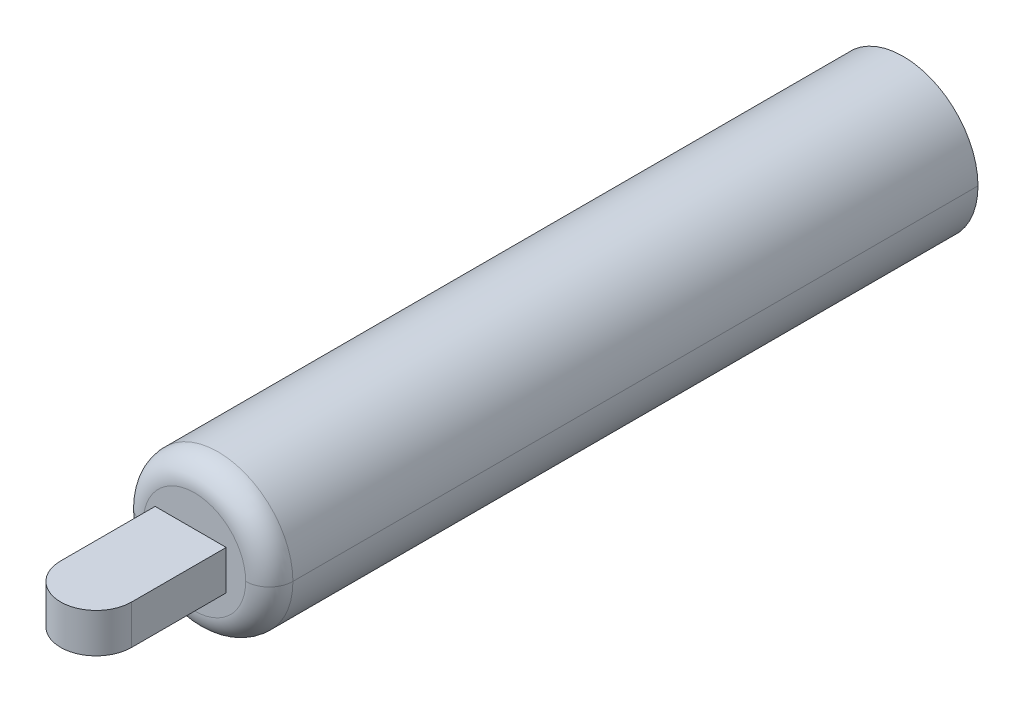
ISO-10303-21;
HEADER;
FILE_DESCRIPTION(('STEP AP214'),'2;1');
FILE_NAME('part.step','',(''),(''),'','','');
FILE_SCHEMA(('AUTOMOTIVE_DESIGN { 1 0 10303 214 1 1 1 1 }'));
ENDSEC;
DATA;
#1=APPLICATION_CONTEXT('core data for automotive mechanical design processes');
#2=APPLICATION_PROTOCOL_DEFINITION('international standard','automotive_design',2000,#1);
#3=PRODUCT_CONTEXT('',#1,'mechanical');
#4=PRODUCT('Part','Part','',(#3));
#5=PRODUCT_RELATED_PRODUCT_CATEGORY('part','',(#4));
#6=PRODUCT_DEFINITION_FORMATION('','',#4);
#7=PRODUCT_DEFINITION_CONTEXT('part definition',#1,'design');
#8=PRODUCT_DEFINITION('design','',#6,#7);
#9=PRODUCT_DEFINITION_SHAPE('','',#8);
#10=(LENGTH_UNIT() NAMED_UNIT(*) SI_UNIT(.MILLI.,.METRE.));
#11=(NAMED_UNIT(*) PLANE_ANGLE_UNIT() SI_UNIT($,.RADIAN.));
#12=(NAMED_UNIT(*) SI_UNIT($,.STERADIAN.) SOLID_ANGLE_UNIT());
#13=UNCERTAINTY_MEASURE_WITH_UNIT(LENGTH_MEASURE(1.E-05),#10,'distance_accuracy_value','');
#14=(GEOMETRIC_REPRESENTATION_CONTEXT(3) GLOBAL_UNCERTAINTY_ASSIGNED_CONTEXT((#13)) GLOBAL_UNIT_ASSIGNED_CONTEXT((#10,
#11,#12)) REPRESENTATION_CONTEXT('',''));
#15=CARTESIAN_POINT('',(0.,0.,0.));
#16=DIRECTION('',(0.,0.,1.));
#17=DIRECTION('',(1.,0.,0.));
#18=AXIS2_PLACEMENT_3D('',#15,#16,#17);
#19=CARTESIAN_POINT('',(0.,0.,220.));
#20=DIRECTION('',(0.,0.,-1.));
#21=DIRECTION('',(1.,0.,0.));
#22=AXIS2_PLACEMENT_3D('',#19,#20,#21);
#23=PLANE('',#22);
#24=CARTESIAN_POINT('',(0.,0.,220.));
#25=DIRECTION('',(0.,0.,-1.));
#26=DIRECTION('',(1.,0.,0.));
#27=AXIS2_PLACEMENT_3D('',#24,#25,#26);
#28=CIRCLE('',#27,19.);
#29=CARTESIAN_POINT('',(-19.,0.,220.));
#30=VERTEX_POINT('',#29);
#31=CARTESIAN_POINT('',(19.,0.,220.));
#32=VERTEX_POINT('',#31);
#33=EDGE_CURVE('E36',#30,#32,#28,.T.);
#34=ORIENTED_EDGE('',*,*,#33,.T.);
#35=CARTESIAN_POINT('',(0.,0.,220.));
#36=DIRECTION('',(0.,0.,-1.));
#37=DIRECTION('',(1.,0.,0.));
#38=AXIS2_PLACEMENT_3D('',#35,#36,#37);
#39=CIRCLE('',#38,19.);
#40=EDGE_CURVE('E13',#32,#30,#39,.T.);
#41=ORIENTED_EDGE('',*,*,#40,.T.);
#42=EDGE_LOOP('',(#34,#41));
#43=FACE_BOUND('',#42,.T.);
#44=ADVANCED_FACE('F25',(#43),#23,.T.);
#45=CARTESIAN_POINT('',(0.,0.,260.));
#46=DIRECTION('',(0.,0.,-1.));
#47=DIRECTION('',(1.,0.,0.));
#48=AXIS2_PLACEMENT_3D('',#45,#46,#47);
#49=CYLINDRICAL_SURFACE('',#48,19.);
#50=DIRECTION('',(0.,0.,1.));
#51=VECTOR('',#50,1.);
#52=CARTESIAN_POINT('',(19.,0.,260.));
#53=LINE('',#52,#51);
#54=CARTESIAN_POINT('',(19.,0.,394.));
#55=VERTEX_POINT('',#54);
#56=EDGE_CURVE('E29',#32,#55,#53,.T.);
#57=ORIENTED_EDGE('',*,*,#56,.T.);
#58=CARTESIAN_POINT('',(0.,0.,394.));
#59=DIRECTION('',(0.,0.,1.));
#60=DIRECTION('',(1.,0.,0.));
#61=AXIS2_PLACEMENT_3D('',#58,#59,#60);
#62=CIRCLE('',#61,19.);
#63=CARTESIAN_POINT('',(-19.,0.,394.));
#64=VERTEX_POINT('',#63);
#65=EDGE_CURVE('E169',#64,#55,#62,.T.);
#66=ORIENTED_EDGE('',*,*,#65,.F.);
#67=DIRECTION('',(0.,0.,1.));
#68=VECTOR('',#67,1.);
#69=CARTESIAN_POINT('',(-19.,0.,260.));
#70=LINE('',#69,#68);
#71=EDGE_CURVE('E189',#30,#64,#70,.T.);
#72=ORIENTED_EDGE('',*,*,#71,.F.);
#73=ORIENTED_EDGE('',*,*,#40,.F.);
#74=EDGE_LOOP('',(#57,#66,#72,#73));
#75=FACE_BOUND('',#74,.T.);
#76=ADVANCED_FACE('F270',(#75),#49,.T.);
#77=CARTESIAN_POINT('',(0.,0.,260.));
#78=DIRECTION('',(0.,0.,-1.));
#79=DIRECTION('',(1.,0.,0.));
#80=AXIS2_PLACEMENT_3D('',#77,#78,#79);
#81=CYLINDRICAL_SURFACE('',#80,19.);
#82=ORIENTED_EDGE('',*,*,#71,.T.);
#83=CARTESIAN_POINT('',(0.,0.,394.));
#84=DIRECTION('',(0.,0.,1.));
#85=DIRECTION('',(1.,0.,0.));
#86=AXIS2_PLACEMENT_3D('',#83,#84,#85);
#87=CIRCLE('',#86,19.);
#88=EDGE_CURVE('E164',#55,#64,#87,.T.);
#89=ORIENTED_EDGE('',*,*,#88,.F.);
#90=ORIENTED_EDGE('',*,*,#56,.F.);
#91=ORIENTED_EDGE('',*,*,#33,.F.);
#92=EDGE_LOOP('',(#82,#89,#90,#91));
#93=FACE_BOUND('',#92,.T.);
#94=ADVANCED_FACE('F275',(#93),#81,.T.);
#95=CARTESIAN_POINT('',(-0.974897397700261,-2.80209038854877,423.999785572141));
#96=DIRECTION('',(-0.392752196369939,-7.47806600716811E-07,-0.919644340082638));
#97=DIRECTION('',(0.919340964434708,-0.0256841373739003,-0.392622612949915));
#98=AXIS2_PLACEMENT_3D('',#95,#96,#97);
#99=SPHERICAL_SURFACE('',#98,6.);
#100=CARTESIAN_POINT('',(1.20483022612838,-5.,418.859943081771));
#101=CARTESIAN_POINT('',(1.56529956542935,-5.,419.012812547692));
#102=CARTESIAN_POINT('',(1.91663037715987,-5.,419.199090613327));
#103=CARTESIAN_POINT('',(2.25187179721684,-5.,419.417606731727));
#104=CARTESIAN_POINT('',(2.91258805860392,-5.,419.937987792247));
#105=CARTESIAN_POINT('',(3.46649602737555,-5.,420.574014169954));
#106=CARTESIAN_POINT('',(3.72304659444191,-5.,420.935313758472));
#107=CARTESIAN_POINT('',(4.16647281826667,-5.,421.71224264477));
#108=CARTESIAN_POINT('',(4.44790115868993,-5.,422.561591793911));
#109=CARTESIAN_POINT('',(4.54632647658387,-5.,423.00406483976));
#110=CARTESIAN_POINT('',(4.63400133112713,-5.,423.746141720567));
#111=CARTESIAN_POINT('',(4.59812564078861,-5.,424.489306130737));
#112=CARTESIAN_POINT('',(4.56475118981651,-5.,424.780923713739));
#113=CARTESIAN_POINT('',(4.4886253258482,-5.,425.199961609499));
#114=CARTESIAN_POINT('',(4.37418506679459,-5.,425.606855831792));
#115=CARTESIAN_POINT('',(4.3347329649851,-5.,425.732703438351));
#116=CARTESIAN_POINT('',(4.2917253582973,-5.,425.856936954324));
#117=CARTESIAN_POINT('',(4.24531439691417,-5.,425.979326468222));
#118=(BOUNDED_CURVE() B_SPLINE_CURVE(5,(#100,#101,#102,#103,#104,#105,#106,#107,#108,#109,#110,
#111,#112,#113,#114,#115,#116,#117),.UNSPECIFIED.,.F.,.F.) B_SPLINE_CURVE_WITH_KNOTS((6,3,3,3,3,
6),(0.,2.82262714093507,5.93491516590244,9.11765543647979,11.1916300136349,12.1352366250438),
.UNSPECIFIED.) CURVE() GEOMETRIC_REPRESENTATION_ITEM() RATIONAL_B_SPLINE_CURVE((1.,1.,1.,1.,1.,
1.,1.,1.,1.,1.,1.,1.,1.,1.,1.,1.,1.,1.)) REPRESENTATION_ITEM(''));
#119=CARTESIAN_POINT('',(1.20483022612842,-5.,418.859943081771));
#120=VERTEX_POINT('',#119);
#121=CARTESIAN_POINT('',(4.24531439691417,-5.,425.979326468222));
#122=VERTEX_POINT('',#121);
#123=EDGE_CURVE('E176',#120,#122,#118,.T.);
#124=ORIENTED_EDGE('',*,*,#123,.T.);
#125=CARTESIAN_POINT('',(-0.974897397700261,-2.80209038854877,423.999785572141));
#126=DIRECTION('',(0.440899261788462,0.877583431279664,-0.188295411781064));
#127=DIRECTION('',(0.807064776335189,-0.479423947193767,-0.344672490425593));
#128=AXIS2_PLACEMENT_3D('',#125,#126,#127);
#129=CIRCLE('',#128,6.);
#130=CARTESIAN_POINT('',(1.38161578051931,-2.80208590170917,429.517651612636));
#131=VERTEX_POINT('',#130);
#132=EDGE_CURVE('E195',#131,#122,#129,.T.);
#133=ORIENTED_EDGE('',*,*,#132,.F.);
#134=CARTESIAN_POINT('',(-0.974897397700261,-2.80209038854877,423.999785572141));
#135=DIRECTION('',(-0.440899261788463,-0.877583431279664,0.188295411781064));
#136=DIRECTION('',(-0.807064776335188,0.479423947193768,0.344672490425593));
#137=AXIS2_PLACEMENT_3D('',#134,#135,#136);
#138=CIRCLE('',#137,6.);
#139=CARTESIAN_POINT('',(-3.33141057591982,-2.80209487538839,418.481919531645));
#140=VERTEX_POINT('',#139);
#141=EDGE_CURVE('E217',#131,#140,#138,.T.);
#142=ORIENTED_EDGE('',*,*,#141,.T.);
#143=CARTESIAN_POINT('',(-0.974897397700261,-2.80209038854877,423.999785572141));
#144=DIRECTION('',(0.440899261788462,0.877583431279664,-0.188295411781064));
#145=DIRECTION('',(0.807064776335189,-0.479423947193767,-0.344672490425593));
#146=AXIS2_PLACEMENT_3D('',#143,#144,#145);
#147=CIRCLE('',#146,6.);
#148=EDGE_CURVE('E188',#120,#140,#147,.T.);
#149=ORIENTED_EDGE('',*,*,#148,.F.);
#150=EDGE_LOOP('',(#124,#133,#142,#149));
#151=FACE_BOUND('',#150,.T.);
#152=ADVANCED_FACE('F265',(#151),#99,.F.);
#153=CARTESIAN_POINT('',(-0.974897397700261,-2.80209038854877,423.999785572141));
#154=DIRECTION('',(-0.392752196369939,-7.47806600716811E-07,-0.919644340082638));
#155=DIRECTION('',(0.919340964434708,-0.0256841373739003,-0.392622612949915));
#156=AXIS2_PLACEMENT_3D('',#153,#154,#155);
#157=SPHERICAL_SURFACE('',#156,6.);
#158=CARTESIAN_POINT('',(1.20483022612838,-5.,418.859943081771));
#159=CARTESIAN_POINT('',(0.974144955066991,-5.,418.762113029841));
#160=CARTESIAN_POINT('',(0.739717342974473,-5.,418.677965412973));
#161=CARTESIAN_POINT('',(0.503302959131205,-5.,418.607812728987));
#162=CARTESIAN_POINT('',(0.0558490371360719,-5.,418.50141763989));
#163=CARTESIAN_POINT('',(-0.377747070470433,-5.,418.44317686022));
#164=CARTESIAN_POINT('',(-0.57761291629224,-5.,418.425868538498));
#165=CARTESIAN_POINT('',(-0.909399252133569,-5.,418.411582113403));
#166=CARTESIAN_POINT('',(-1.2153268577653,-5.,418.419862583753));
#167=CARTESIAN_POINT('',(-1.33882200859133,-5.,418.426773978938));
#168=CARTESIAN_POINT('',(-1.58124733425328,-5.,418.446785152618));
#169=CARTESIAN_POINT('',(-1.80346256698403,-5.,418.476943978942));
#170=CARTESIAN_POINT('',(-1.91204442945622,-5.,418.494507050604));
#171=CARTESIAN_POINT('',(-2.1330949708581,-5.,418.535593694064));
#172=CARTESIAN_POINT('',(-2.33579041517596,-5.,418.583617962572));
#173=CARTESIAN_POINT('',(-2.4387550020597,-5.,418.610670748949));
#174=CARTESIAN_POINT('',(-2.74720218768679,-5.,418.699279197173));
#175=CARTESIAN_POINT('',(-3.02707013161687,-5.,418.802024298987));
#176=CARTESIAN_POINT('',(-3.21013373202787,-5.,418.878148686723));
#177=CARTESIAN_POINT('',(-3.47179212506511,-5.,419.000076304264));
#178=CARTESIAN_POINT('',(-3.73951622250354,-5.,419.148041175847));
#179=CARTESIAN_POINT('',(-3.82258921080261,-5.,419.196230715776));
#180=CARTESIAN_POINT('',(-4.04575330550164,-5.,419.332274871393));
#181=CARTESIAN_POINT('',(-4.28027752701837,-5.,419.495074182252));
#182=CARTESIAN_POINT('',(-4.43210247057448,-5.,419.609317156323));
#183=CARTESIAN_POINT('',(-4.7132328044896,-5.,419.841410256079));
#184=CARTESIAN_POINT('',(-5.00715397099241,-5.,420.131854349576));
#185=CARTESIAN_POINT('',(-5.13725763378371,-5.,420.271228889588));
#186=CARTESIAN_POINT('',(-5.35847636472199,-5.,420.530887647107));
#187=CARTESIAN_POINT('',(-5.57028554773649,-5.,420.823955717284));
#188=CARTESIAN_POINT('',(-5.65574871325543,-5.,420.95104776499));
#189=CARTESIAN_POINT('',(-5.82318884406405,-5.,421.219944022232));
#190=CARTESIAN_POINT('',(-5.97473820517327,-5.,421.507373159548));
#191=CARTESIAN_POINT('',(-6.04707710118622,-5.,421.65790207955));
#192=CARTESIAN_POINT('',(-6.26564611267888,-5.,422.160494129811));
#193=CARTESIAN_POINT('',(-6.42451566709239,-5.,422.696848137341));
#194=CARTESIAN_POINT('',(-6.50208590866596,-5.,423.079397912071));
#195=CARTESIAN_POINT('',(-6.59541301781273,-5.,423.903810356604));
#196=CARTESIAN_POINT('',(-6.53555057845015,-5.,424.734058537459));
#197=CARTESIAN_POINT('',(-6.46051109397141,-5.,425.169330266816));
#198=CARTESIAN_POINT('',(-6.22293074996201,-5.,426.030353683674));
#199=CARTESIAN_POINT('',(-5.82022250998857,-5.,426.827871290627));
#200=CARTESIAN_POINT('',(-5.57607349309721,-5.,427.209868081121));
#201=CARTESIAN_POINT('',(-5.11150469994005,-5.,427.796286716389));
#202=CARTESIAN_POINT('',(-4.55863902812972,-5.,428.295807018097));
#203=CARTESIAN_POINT('',(-4.32763327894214,-5.,428.478388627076));
#204=CARTESIAN_POINT('',(-3.85847345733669,-5.,428.801352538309));
#205=CARTESIAN_POINT('',(-3.35592294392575,-5.,429.060618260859));
#206=CARTESIAN_POINT('',(-3.10627263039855,-5.,429.170549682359));
#207=CARTESIAN_POINT('',(-2.62837090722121,-5.,429.346963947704));
#208=CARTESIAN_POINT('',(-2.14807709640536,-5.,429.465408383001));
#209=CARTESIAN_POINT('',(-1.92408252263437,-5.,429.508278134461));
#210=CARTESIAN_POINT('',(-1.60401553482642,-5.,429.552989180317));
#211=CARTESIAN_POINT('',(-1.29898683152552,-5.,429.57453791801));
#212=CARTESIAN_POINT('',(-1.20478326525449,-5.,429.579150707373));
#213=CARTESIAN_POINT('',(-0.9757190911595,-5.,429.585619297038));
#214=CARTESIAN_POINT('',(-0.759303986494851,-5.,429.580748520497));
#215=CARTESIAN_POINT('',(-0.635046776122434,-5.,429.574340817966));
#216=CARTESIAN_POINT('',(-0.391424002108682,-5.,429.55526436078));
#217=CARTESIAN_POINT('',(-0.168034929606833,-5.,429.525851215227));
#218=CARTESIAN_POINT('',(-0.0590306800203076,-5.,429.508654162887));
#219=CARTESIAN_POINT('',(0.162536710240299,-5.,429.468344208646));
#220=CARTESIAN_POINT('',(0.365635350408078,-5.,429.421027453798));
#221=CARTESIAN_POINT('',(0.46863957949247,-5.,429.394376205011));
#222=CARTESIAN_POINT('',(0.777074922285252,-5.,429.307027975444));
#223=CARTESIAN_POINT('',(1.05642928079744,-5.,429.20568559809));
#224=CARTESIAN_POINT('',(1.23886330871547,-5.,429.13067102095));
#225=CARTESIAN_POINT('',(1.49989254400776,-5.,429.010371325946));
#226=CARTESIAN_POINT('',(1.7662218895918,-5.,428.864841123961));
#227=CARTESIAN_POINT('',(1.84935187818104,-5.,428.81715305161));
#228=CARTESIAN_POINT('',(2.07322455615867,-5.,428.682173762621));
#229=CARTESIAN_POINT('',(2.30827205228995,-5.,428.520715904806));
#230=CARTESIAN_POINT('',(2.46073460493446,-5.,428.407160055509));
#231=CARTESIAN_POINT('',(2.74270900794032,-5.,428.176709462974));
#232=CARTESIAN_POINT('',(3.03817458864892,-5.,427.887593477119));
#233=CARTESIAN_POINT('',(3.16882109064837,-5.,427.749040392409));
#234=CARTESIAN_POINT('',(3.39090077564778,-5.,427.49101783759));
#235=CARTESIAN_POINT('',(3.60406895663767,-5.,427.199214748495));
#236=CARTESIAN_POINT('',(3.68996090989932,-5.,427.072910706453));
#237=CARTESIAN_POINT('',(3.8670874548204,-5.,426.791779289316));
#238=CARTESIAN_POINT('',(4.02696656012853,-5.,426.48990358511));
#239=CARTESIAN_POINT('',(4.10635640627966,-5.,426.323868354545));
#240=CARTESIAN_POINT('',(4.17928023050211,-5.,426.153463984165));
#241=CARTESIAN_POINT('',(4.24531439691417,-5.,425.979326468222));
#242=(BOUNDED_CURVE() B_SPLINE_CURVE(5,(#158,#159,#160,#161,#162,#163,#164,#165,#166,#167,#168,
#169,#170,#171,#172,#173,#174,#175,#176,#177,#178,#179,#180,#181,#182,#183,#184,#185,#186,#187,
#188,#189,#190,#191,#192,#193,#194,#195,#196,#197,#198,#199,#200,#201,#202,#203,#204,#205,#206,
#207,#208,#209,#210,#211,#212,#213,#214,#215,#216,#217,#218,#219,#220,#221,#222,#223,#224,#225,
#226,#227,#228,#229,#230,#231,#232,#233,#234,#235,#236,#237,#238,#239,#240,#241),.UNSPECIFIED.,
.F.,.F.) B_SPLINE_CURVE_WITH_KNOTS((6,3,3,3,3,3,3,3,3,3,3,3,3,3,3,3,3,3,3,3,3,3,3,3,3,3,3,6),
(0.,1.80636308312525,3.43217170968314,4.60938116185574,5.84082462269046,7.22729750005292,
10.1479292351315,11.4397263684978,13.5637272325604,15.2223743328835,16.3993946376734,
17.6189101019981,20.3744150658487,23.476788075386,26.6600365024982,28.7397489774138,
30.6929987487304,32.4239847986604,33.2181559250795,34.3951243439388,35.6227300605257,
37.0011054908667,39.9047750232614,41.2014228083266,43.3439529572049,45.0099721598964,
46.1870602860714,47.5296369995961),
.UNSPECIFIED.) CURVE() GEOMETRIC_REPRESENTATION_ITEM() RATIONAL_B_SPLINE_CURVE((1.,1.,1.,1.,1.,
1.,1.,1.,1.,1.,1.,1.,1.,1.,1.,1.,1.,1.,1.,1.,1.,1.,1.,1.,1.,1.,1.,1.,1.,1.,1.,1.,1.,1.,1.,1.,1.,
1.,1.,1.,1.,1.,1.,1.,1.,1.,1.,1.,1.,1.,1.,1.,1.,1.,1.,1.,1.,1.,1.,1.,1.,1.,1.,1.,1.,1.,1.,1.,1.,
1.,1.,1.,1.,1.,1.,1.,1.,1.,1.,1.,1.,1.,1.,1.)) REPRESENTATION_ITEM(''));
#243=EDGE_CURVE('E182',#120,#122,#242,.T.);
#244=ORIENTED_EDGE('',*,*,#243,.F.);
#245=ORIENTED_EDGE('',*,*,#148,.T.);
#246=ORIENTED_EDGE('',*,*,#141,.F.);
#247=ORIENTED_EDGE('',*,*,#132,.T.);
#248=EDGE_LOOP('',(#244,#245,#246,#247));
#249=FACE_BOUND('',#248,.T.);
#250=ADVANCED_FACE('F27',(#249),#157,.F.);
#251=CARTESIAN_POINT('',(0.,-5.,0.));
#252=DIRECTION('',(0.,1.,0.));
#253=DIRECTION('',(-1.,0.,0.));
#254=AXIS2_PLACEMENT_3D('',#251,#252,#253);
#255=PLANE('',#254);
#256=ORIENTED_EDGE('',*,*,#123,.F.);
#257=ORIENTED_EDGE('',*,*,#243,.T.);
#258=EDGE_LOOP('',(#256,#257));
#259=FACE_BOUND('',#258,.T.);
#260=DIRECTION('',(-1.,0.,0.));
#261=VECTOR('',#260,1.);
#262=CARTESIAN_POINT('',(-0.974897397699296,-5.,400.));
#263=LINE('',#262,#261);
#264=CARTESIAN_POINT('',(8.0502052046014,-5.,400.));
#265=VERTEX_POINT('',#264);
#266=CARTESIAN_POINT('',(-10.,-5.,400.));
#267=VERTEX_POINT('',#266);
#268=EDGE_CURVE('E134',#265,#267,#263,.T.);
#269=ORIENTED_EDGE('',*,*,#268,.F.);
#270=DIRECTION('',(0.,0.,-1.));
#271=VECTOR('',#270,1.);
#272=CARTESIAN_POINT('',(8.0502052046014,-5.,411.99989278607));
#273=LINE('',#272,#271);
#274=CARTESIAN_POINT('',(8.05020520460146,-5.,423.999785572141));
#275=VERTEX_POINT('',#274);
#276=EDGE_CURVE('E171',#275,#265,#273,.T.);
#277=ORIENTED_EDGE('',*,*,#276,.F.);
#278=CARTESIAN_POINT('',(-0.974897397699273,-5.,423.999785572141));
#279=DIRECTION('',(0.,1.,0.));
#280=DIRECTION('',(-1.,0.,0.));
#281=AXIS2_PLACEMENT_3D('',#278,#279,#280);
#282=CIRCLE('',#281,9.02510260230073);
#283=CARTESIAN_POINT('',(-10.,-5.,423.999785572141));
#284=VERTEX_POINT('',#283);
#285=EDGE_CURVE('E159',#284,#275,#282,.T.);
#286=ORIENTED_EDGE('',*,*,#285,.F.);
#287=DIRECTION('',(0.,0.,1.));
#288=VECTOR('',#287,1.);
#289=CARTESIAN_POINT('',(-10.,-5.,411.99989278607));
#290=LINE('',#289,#288);
#291=EDGE_CURVE('E145',#267,#284,#290,.T.);
#292=ORIENTED_EDGE('',*,*,#291,.F.);
#293=EDGE_LOOP('',(#269,#277,#286,#292));
#294=FACE_BOUND('',#293,.T.);
#295=ADVANCED_FACE('F249',(#259,#294),#255,.F.);
#296=CARTESIAN_POINT('',(0.,0.,394.));
#297=DIRECTION('',(0.,0.,1.));
#298=DIRECTION('',(-0.516986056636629,0.855993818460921,0.));
#299=AXIS2_PLACEMENT_3D('',#296,#297,#298);
#300=TOROIDAL_SURFACE('',#299,13.,6.);
#301=CARTESIAN_POINT('',(-13.,0.,394.));
#302=DIRECTION('',(0.,-1.,0.));
#303=DIRECTION('',(-1.,0.,0.));
#304=AXIS2_PLACEMENT_3D('',#301,#302,#303);
#305=CIRCLE('',#304,6.);
#306=CARTESIAN_POINT('',(-13.,-4.70163956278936E-08,400.));
#307=VERTEX_POINT('',#306);
#308=EDGE_CURVE('E165',#307,#64,#305,.T.);
#309=ORIENTED_EDGE('',*,*,#308,.T.);
#310=ORIENTED_EDGE('',*,*,#65,.T.);
#311=CARTESIAN_POINT('',(13.,0.,394.));
#312=DIRECTION('',(0.,1.,0.));
#313=DIRECTION('',(1.,0.,0.));
#314=AXIS2_PLACEMENT_3D('',#311,#312,#313);
#315=CIRCLE('',#314,6.);
#316=CARTESIAN_POINT('',(13.,0.,400.));
#317=VERTEX_POINT('',#316);
#318=EDGE_CURVE('E160',#317,#55,#315,.T.);
#319=ORIENTED_EDGE('',*,*,#318,.F.);
#320=CARTESIAN_POINT('',(0.,0.,400.));
#321=DIRECTION('',(0.,0.,1.));
#322=DIRECTION('',(1.,0.,0.));
#323=AXIS2_PLACEMENT_3D('',#320,#321,#322);
#324=CIRCLE('',#323,13.);
#325=EDGE_CURVE('E126',#307,#317,#324,.T.);
#326=ORIENTED_EDGE('',*,*,#325,.F.);
#327=EDGE_LOOP('',(#309,#310,#319,#326));
#328=FACE_BOUND('',#327,.T.);
#329=ADVANCED_FACE('F254',(#328),#300,.T.);
#330=CARTESIAN_POINT('',(0.,0.,394.));
#331=DIRECTION('',(0.,0.,1.));
#332=DIRECTION('',(0.598947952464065,-0.800787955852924,0.));
#333=AXIS2_PLACEMENT_3D('',#330,#331,#332);
#334=TOROIDAL_SURFACE('',#333,13.,6.);
#335=ORIENTED_EDGE('',*,*,#318,.T.);
#336=ORIENTED_EDGE('',*,*,#88,.T.);
#337=ORIENTED_EDGE('',*,*,#308,.F.);
#338=CARTESIAN_POINT('',(0.,0.,400.));
#339=DIRECTION('',(0.,0.,1.));
#340=DIRECTION('',(1.,0.,0.));
#341=AXIS2_PLACEMENT_3D('',#338,#339,#340);
#342=CIRCLE('',#341,13.);
#343=EDGE_CURVE('E156',#317,#307,#342,.T.);
#344=ORIENTED_EDGE('',*,*,#343,.F.);
#345=EDGE_LOOP('',(#335,#336,#337,#344));
#346=FACE_BOUND('',#345,.T.);
#347=ADVANCED_FACE('F262',(#346),#334,.T.);
#348=CARTESIAN_POINT('',(0.,0.,400.));
#349=DIRECTION('',(0.,0.,1.));
#350=DIRECTION('',(1.,0.,0.));
#351=AXIS2_PLACEMENT_3D('',#348,#349,#350);
#352=PLANE('',#351);
#353=DIRECTION('',(0.,-1.,0.));
#354=VECTOR('',#353,1.);
#355=CARTESIAN_POINT('',(-10.,0.,400.));
#356=LINE('',#355,#354);
#357=CARTESIAN_POINT('',(-10.,5.,400.));
#358=VERTEX_POINT('',#357);
#359=EDGE_CURVE('E130',#358,#267,#356,.T.);
#360=ORIENTED_EDGE('',*,*,#359,.F.);
#361=DIRECTION('',(-1.,0.,0.));
#362=VECTOR('',#361,1.);
#363=CARTESIAN_POINT('',(-0.974897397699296,5.,400.));
#364=LINE('',#363,#362);
#365=CARTESIAN_POINT('',(8.0502052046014,5.,400.));
#366=VERTEX_POINT('',#365);
#367=EDGE_CURVE('E113',#366,#358,#364,.T.);
#368=ORIENTED_EDGE('',*,*,#367,.F.);
#369=DIRECTION('',(0.,-1.,0.));
#370=VECTOR('',#369,1.);
#371=CARTESIAN_POINT('',(8.0502052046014,0.,400.));
#372=LINE('',#371,#370);
#373=EDGE_CURVE('E127',#366,#265,#372,.T.);
#374=ORIENTED_EDGE('',*,*,#373,.T.);
#375=ORIENTED_EDGE('',*,*,#268,.T.);
#376=EDGE_LOOP('',(#360,#368,#374,#375));
#377=FACE_BOUND('',#376,.T.);
#378=ORIENTED_EDGE('',*,*,#325,.T.);
#379=ORIENTED_EDGE('',*,*,#343,.T.);
#380=EDGE_LOOP('',(#378,#379));
#381=FACE_BOUND('',#380,.T.);
#382=ADVANCED_FACE('F132',(#377,#381),#352,.T.);
#383=CARTESIAN_POINT('',(0.,5.,0.));
#384=DIRECTION('',(0.,1.,0.));
#385=DIRECTION('',(-1.,0.,0.));
#386=AXIS2_PLACEMENT_3D('',#383,#384,#385);
#387=PLANE('',#386);
#388=DIRECTION('',(0.,0.,1.));
#389=VECTOR('',#388,1.);
#390=CARTESIAN_POINT('',(-10.,5.,411.99989278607));
#391=LINE('',#390,#389);
#392=CARTESIAN_POINT('',(-10.,5.,423.999785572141));
#393=VERTEX_POINT('',#392);
#394=EDGE_CURVE('E119',#358,#393,#391,.T.);
#395=ORIENTED_EDGE('',*,*,#394,.T.);
#396=CARTESIAN_POINT('',(-0.974897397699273,5.,423.999785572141));
#397=DIRECTION('',(0.,1.,0.));
#398=DIRECTION('',(-1.,0.,0.));
#399=AXIS2_PLACEMENT_3D('',#396,#397,#398);
#400=CIRCLE('',#399,9.02510260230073);
#401=CARTESIAN_POINT('',(8.05020520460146,5.,423.999785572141));
#402=VERTEX_POINT('',#401);
#403=EDGE_CURVE('E152',#393,#402,#400,.T.);
#404=ORIENTED_EDGE('',*,*,#403,.T.);
#405=DIRECTION('',(0.,0.,-1.));
#406=VECTOR('',#405,1.);
#407=CARTESIAN_POINT('',(8.0502052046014,5.,411.99989278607));
#408=LINE('',#407,#406);
#409=EDGE_CURVE('E121',#402,#366,#408,.T.);
#410=ORIENTED_EDGE('',*,*,#409,.T.);
#411=ORIENTED_EDGE('',*,*,#367,.T.);
#412=EDGE_LOOP('',(#395,#404,#410,#411));
#413=FACE_BOUND('',#412,.T.);
#414=ADVANCED_FACE('F116',(#413),#387,.T.);
#415=CARTESIAN_POINT('',(8.0502052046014,0.,423.999785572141));
#416=DIRECTION('',(1.,0.,0.));
#417=DIRECTION('',(0.,0.,-1.));
#418=AXIS2_PLACEMENT_3D('',#415,#416,#417);
#419=PLANE('',#418);
#420=ORIENTED_EDGE('',*,*,#409,.F.);
#421=DIRECTION('',(0.,1.,0.));
#422=VECTOR('',#421,1.);
#423=CARTESIAN_POINT('',(8.05020520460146,0.,423.999785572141));
#424=LINE('',#423,#422);
#425=EDGE_CURVE('E181',#275,#402,#424,.T.);
#426=ORIENTED_EDGE('',*,*,#425,.F.);
#427=ORIENTED_EDGE('',*,*,#276,.T.);
#428=ORIENTED_EDGE('',*,*,#373,.F.);
#429=EDGE_LOOP('',(#420,#426,#427,#428));
#430=FACE_BOUND('',#429,.T.);
#431=ADVANCED_FACE('F246',(#430),#419,.T.);
#432=CARTESIAN_POINT('',(-10.,0.,393.99978557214));
#433=DIRECTION('',(-1.,0.,0.));
#434=DIRECTION('',(0.,0.,1.));
#435=AXIS2_PLACEMENT_3D('',#432,#433,#434);
#436=PLANE('',#435);
#437=ORIENTED_EDGE('',*,*,#291,.T.);
#438=DIRECTION('',(0.,1.,0.));
#439=VECTOR('',#438,1.);
#440=CARTESIAN_POINT('',(-10.,0.,423.999785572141));
#441=LINE('',#440,#439);
#442=EDGE_CURVE('E143',#284,#393,#441,.T.);
#443=ORIENTED_EDGE('',*,*,#442,.T.);
#444=ORIENTED_EDGE('',*,*,#394,.F.);
#445=ORIENTED_EDGE('',*,*,#359,.T.);
#446=EDGE_LOOP('',(#437,#443,#444,#445));
#447=FACE_BOUND('',#446,.T.);
#448=ADVANCED_FACE('F141',(#447),#436,.T.);
#449=CARTESIAN_POINT('',(-0.974897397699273,0.,423.999785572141));
#450=DIRECTION('',(0.,-1.,0.));
#451=DIRECTION('',(-1.,0.,0.));
#452=AXIS2_PLACEMENT_3D('',#449,#450,#451);
#453=CYLINDRICAL_SURFACE('',#452,9.02510260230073);
#454=ORIENTED_EDGE('',*,*,#442,.F.);
#455=ORIENTED_EDGE('',*,*,#285,.T.);
#456=ORIENTED_EDGE('',*,*,#425,.T.);
#457=ORIENTED_EDGE('',*,*,#403,.F.);
#458=EDGE_LOOP('',(#454,#455,#456,#457));
#459=FACE_BOUND('',#458,.T.);
#460=ADVANCED_FACE('F242',(#459),#453,.T.);
#461=CLOSED_SHELL('',(#44,#76,#94,#152,#250,#295,#329,#347,#382,#414,#431,#448,#460));
#462=MANIFOLD_SOLID_BREP('B1',#461);
#463=ADVANCED_BREP_SHAPE_REPRESENTATION('',(#18,#462),#14);
#464=SHAPE_DEFINITION_REPRESENTATION(#9,#463);
ENDSEC;
END-ISO-10303-21;
